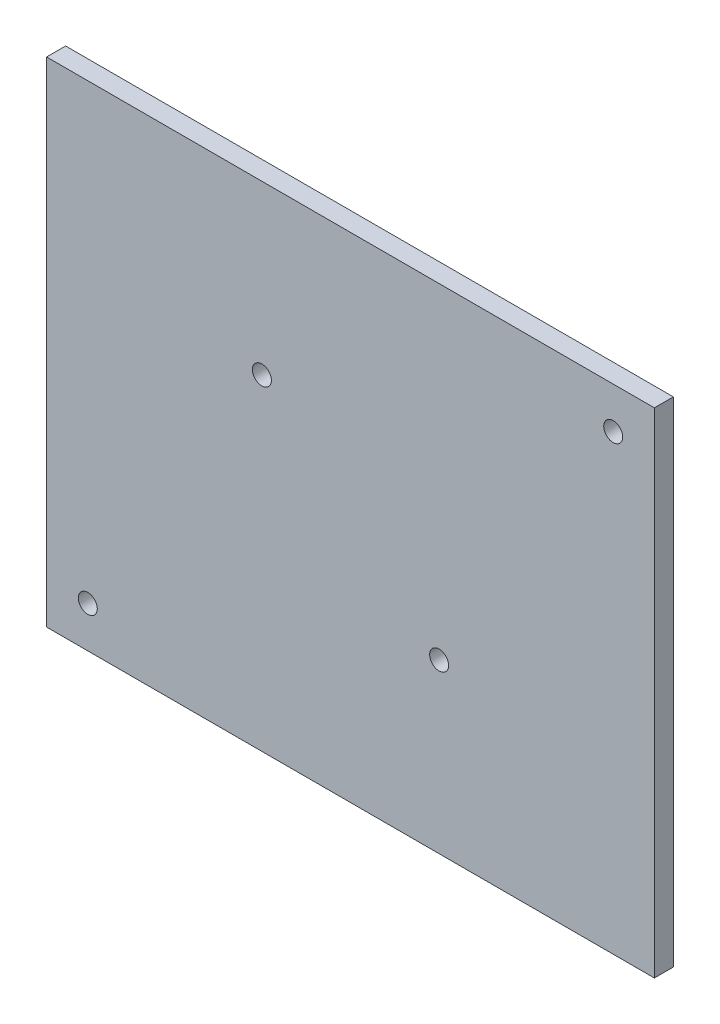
ISO-10303-21;
HEADER;
FILE_DESCRIPTION(('STEP AP214'),'2;1');
FILE_NAME('part.step','',(''),(''),'','','');
FILE_SCHEMA(('AUTOMOTIVE_DESIGN { 1 0 10303 214 1 1 1 1 }'));
ENDSEC;
DATA;
#1=APPLICATION_CONTEXT('core data for automotive mechanical design processes');
#2=APPLICATION_PROTOCOL_DEFINITION('international standard','automotive_design',2000,#1);
#3=PRODUCT_CONTEXT('',#1,'mechanical');
#4=PRODUCT('Part','Part','',(#3));
#5=PRODUCT_RELATED_PRODUCT_CATEGORY('part','',(#4));
#6=PRODUCT_DEFINITION_FORMATION('','',#4);
#7=PRODUCT_DEFINITION_CONTEXT('part definition',#1,'design');
#8=PRODUCT_DEFINITION('design','',#6,#7);
#9=PRODUCT_DEFINITION_SHAPE('','',#8);
#10=(LENGTH_UNIT() NAMED_UNIT(*) SI_UNIT(.MILLI.,.METRE.));
#11=(NAMED_UNIT(*) PLANE_ANGLE_UNIT() SI_UNIT($,.RADIAN.));
#12=(NAMED_UNIT(*) SI_UNIT($,.STERADIAN.) SOLID_ANGLE_UNIT());
#13=UNCERTAINTY_MEASURE_WITH_UNIT(LENGTH_MEASURE(1.E-05),#10,'distance_accuracy_value','');
#14=(GEOMETRIC_REPRESENTATION_CONTEXT(3) GLOBAL_UNCERTAINTY_ASSIGNED_CONTEXT((#13)) GLOBAL_UNIT_ASSIGNED_CONTEXT((#10,
#11,#12)) REPRESENTATION_CONTEXT('',''));
#15=CARTESIAN_POINT('',(0.,0.,0.));
#16=DIRECTION('',(0.,0.,1.));
#17=DIRECTION('',(1.,0.,0.));
#18=AXIS2_PLACEMENT_3D('',#15,#16,#17);
#19=CARTESIAN_POINT('',(0.,-39.,-3.));
#20=DIRECTION('',(0.,-1.,0.));
#21=DIRECTION('',(0.,0.,-1.));
#22=AXIS2_PLACEMENT_3D('',#19,#20,#21);
#23=PLANE('',#22);
#24=DIRECTION('',(1.,0.,0.));
#25=VECTOR('',#24,1.);
#26=CARTESIAN_POINT('',(0.,-39.,0.));
#27=LINE('',#26,#25);
#28=CARTESIAN_POINT('',(-48.,-39.,0.));
#29=VERTEX_POINT('',#28);
#30=CARTESIAN_POINT('',(48.,-39.,0.));
#31=VERTEX_POINT('',#30);
#32=EDGE_CURVE('E117',#29,#31,#27,.T.);
#33=ORIENTED_EDGE('',*,*,#32,.F.);
#34=DIRECTION('',(0.,0.,1.));
#35=VECTOR('',#34,1.);
#36=CARTESIAN_POINT('',(-48.,-39.,-3.));
#37=LINE('',#36,#35);
#38=CARTESIAN_POINT('',(-48.,-39.,-3.));
#39=VERTEX_POINT('',#38);
#40=EDGE_CURVE('E12',#39,#29,#37,.T.);
#41=ORIENTED_EDGE('',*,*,#40,.F.);
#42=DIRECTION('',(1.,0.,0.));
#43=VECTOR('',#42,1.);
#44=CARTESIAN_POINT('',(0.,-39.,-3.));
#45=LINE('',#44,#43);
#46=CARTESIAN_POINT('',(48.,-39.,-3.));
#47=VERTEX_POINT('',#46);
#48=EDGE_CURVE('E109',#39,#47,#45,.T.);
#49=ORIENTED_EDGE('',*,*,#48,.T.);
#50=DIRECTION('',(0.,0.,1.));
#51=VECTOR('',#50,1.);
#52=CARTESIAN_POINT('',(48.,-39.,-3.));
#53=LINE('',#52,#51);
#54=EDGE_CURVE('E48',#47,#31,#53,.T.);
#55=ORIENTED_EDGE('',*,*,#54,.T.);
#56=EDGE_LOOP('',(#33,#41,#49,#55));
#57=FACE_BOUND('',#56,.T.);
#58=ADVANCED_FACE('F45',(#57),#23,.T.);
#59=CARTESIAN_POINT('',(-48.,0.,-3.));
#60=DIRECTION('',(1.,0.,0.));
#61=DIRECTION('',(0.,0.,-1.));
#62=AXIS2_PLACEMENT_3D('',#59,#60,#61);
#63=PLANE('',#62);
#64=DIRECTION('',(0.,1.,0.));
#65=VECTOR('',#64,1.);
#66=CARTESIAN_POINT('',(-48.,0.,0.));
#67=LINE('',#66,#65);
#68=CARTESIAN_POINT('',(-48.,39.,0.));
#69=VERTEX_POINT('',#68);
#70=EDGE_CURVE('E79',#29,#69,#67,.T.);
#71=ORIENTED_EDGE('',*,*,#70,.T.);
#72=DIRECTION('',(0.,0.,1.));
#73=VECTOR('',#72,1.);
#74=CARTESIAN_POINT('',(-48.,39.,-3.));
#75=LINE('',#74,#73);
#76=CARTESIAN_POINT('',(-48.,39.,-3.));
#77=VERTEX_POINT('',#76);
#78=EDGE_CURVE('E55',#77,#69,#75,.T.);
#79=ORIENTED_EDGE('',*,*,#78,.F.);
#80=DIRECTION('',(0.,1.,0.));
#81=VECTOR('',#80,1.);
#82=CARTESIAN_POINT('',(-48.,0.,-3.));
#83=LINE('',#82,#81);
#84=EDGE_CURVE('E96',#39,#77,#83,.T.);
#85=ORIENTED_EDGE('',*,*,#84,.F.);
#86=ORIENTED_EDGE('',*,*,#40,.T.);
#87=EDGE_LOOP('',(#71,#79,#85,#86));
#88=FACE_BOUND('',#87,.T.);
#89=ADVANCED_FACE('F134',(#88),#63,.F.);
#90=CARTESIAN_POINT('',(0.,39.,-3.));
#91=DIRECTION('',(0.,-1.,0.));
#92=DIRECTION('',(0.,0.,-1.));
#93=AXIS2_PLACEMENT_3D('',#90,#91,#92);
#94=PLANE('',#93);
#95=DIRECTION('',(1.,0.,0.));
#96=VECTOR('',#95,1.);
#97=CARTESIAN_POINT('',(0.,39.,0.));
#98=LINE('',#97,#96);
#99=CARTESIAN_POINT('',(48.,39.,0.));
#100=VERTEX_POINT('',#99);
#101=EDGE_CURVE('E104',#69,#100,#98,.T.);
#102=ORIENTED_EDGE('',*,*,#101,.T.);
#103=DIRECTION('',(0.,0.,1.));
#104=VECTOR('',#103,1.);
#105=CARTESIAN_POINT('',(48.,39.,-3.));
#106=LINE('',#105,#104);
#107=CARTESIAN_POINT('',(48.,39.,-3.));
#108=VERTEX_POINT('',#107);
#109=EDGE_CURVE('E101',#108,#100,#106,.T.);
#110=ORIENTED_EDGE('',*,*,#109,.F.);
#111=DIRECTION('',(1.,0.,0.));
#112=VECTOR('',#111,1.);
#113=CARTESIAN_POINT('',(0.,39.,-3.));
#114=LINE('',#113,#112);
#115=EDGE_CURVE('E91',#77,#108,#114,.T.);
#116=ORIENTED_EDGE('',*,*,#115,.F.);
#117=ORIENTED_EDGE('',*,*,#78,.T.);
#118=EDGE_LOOP('',(#102,#110,#116,#117));
#119=FACE_BOUND('',#118,.T.);
#120=ADVANCED_FACE('F102',(#119),#94,.F.);
#121=CARTESIAN_POINT('',(48.,0.,-3.));
#122=DIRECTION('',(1.,0.,0.));
#123=DIRECTION('',(0.,0.,-1.));
#124=AXIS2_PLACEMENT_3D('',#121,#122,#123);
#125=PLANE('',#124);
#126=DIRECTION('',(0.,1.,0.));
#127=VECTOR('',#126,1.);
#128=CARTESIAN_POINT('',(48.,0.,0.));
#129=LINE('',#128,#127);
#130=EDGE_CURVE('E121',#31,#100,#129,.T.);
#131=ORIENTED_EDGE('',*,*,#130,.F.);
#132=ORIENTED_EDGE('',*,*,#54,.F.);
#133=DIRECTION('',(0.,1.,0.));
#134=VECTOR('',#133,1.);
#135=CARTESIAN_POINT('',(48.,0.,-3.));
#136=LINE('',#135,#134);
#137=EDGE_CURVE('E95',#47,#108,#136,.T.);
#138=ORIENTED_EDGE('',*,*,#137,.T.);
#139=ORIENTED_EDGE('',*,*,#109,.T.);
#140=EDGE_LOOP('',(#131,#132,#138,#139));
#141=FACE_BOUND('',#140,.T.);
#142=ADVANCED_FACE('F107',(#141),#125,.T.);
#143=CARTESIAN_POINT('',(0.,0.,-3.));
#144=DIRECTION('',(0.,0.,1.));
#145=DIRECTION('',(1.,0.,0.));
#146=AXIS2_PLACEMENT_3D('',#143,#144,#145);
#147=PLANE('',#146);
#148=CARTESIAN_POINT('',(14.,-12.5,-3.));
#149=DIRECTION('',(0.,0.,1.));
#150=DIRECTION('',(1.,0.,0.));
#151=AXIS2_PLACEMENT_3D('',#148,#149,#150);
#152=CIRCLE('',#151,1.5);
#153=CARTESIAN_POINT('',(15.5,-12.5,-3.));
#154=VERTEX_POINT('',#153);
#155=EDGE_CURVE('E197',#154,#154,#152,.T.);
#156=ORIENTED_EDGE('',*,*,#155,.T.);
#157=EDGE_LOOP('',(#156));
#158=FACE_BOUND('',#157,.T.);
#159=CARTESIAN_POINT('',(-41.5,-32.5000000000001,-3.));
#160=DIRECTION('',(0.,0.,1.));
#161=DIRECTION('',(1.,0.,0.));
#162=AXIS2_PLACEMENT_3D('',#159,#160,#161);
#163=CIRCLE('',#162,1.5);
#164=CARTESIAN_POINT('',(-40.,-32.5000000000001,-3.));
#165=VERTEX_POINT('',#164);
#166=EDGE_CURVE('E183',#165,#165,#163,.T.);
#167=ORIENTED_EDGE('',*,*,#166,.T.);
#168=EDGE_LOOP('',(#167));
#169=FACE_BOUND('',#168,.T.);
#170=CARTESIAN_POINT('',(41.5,32.4999999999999,-3.));
#171=DIRECTION('',(0.,0.,1.));
#172=DIRECTION('',(1.,0.,0.));
#173=AXIS2_PLACEMENT_3D('',#170,#171,#172);
#174=CIRCLE('',#173,1.5);
#175=CARTESIAN_POINT('',(43.,32.4999999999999,-3.));
#176=VERTEX_POINT('',#175);
#177=EDGE_CURVE('E177',#176,#176,#174,.T.);
#178=ORIENTED_EDGE('',*,*,#177,.T.);
#179=EDGE_LOOP('',(#178));
#180=FACE_BOUND('',#179,.T.);
#181=CARTESIAN_POINT('',(-14.,12.5,-3.));
#182=DIRECTION('',(0.,0.,1.));
#183=DIRECTION('',(1.,0.,0.));
#184=AXIS2_PLACEMENT_3D('',#181,#182,#183);
#185=CIRCLE('',#184,1.5);
#186=CARTESIAN_POINT('',(-12.5,12.5,-3.));
#187=VERTEX_POINT('',#186);
#188=EDGE_CURVE('E122',#187,#187,#185,.T.);
#189=ORIENTED_EDGE('',*,*,#188,.T.);
#190=EDGE_LOOP('',(#189));
#191=FACE_BOUND('',#190,.T.);
#192=ORIENTED_EDGE('',*,*,#48,.F.);
#193=ORIENTED_EDGE('',*,*,#84,.T.);
#194=ORIENTED_EDGE('',*,*,#115,.T.);
#195=ORIENTED_EDGE('',*,*,#137,.F.);
#196=EDGE_LOOP('',(#192,#193,#194,#195));
#197=FACE_BOUND('',#196,.T.);
#198=ADVANCED_FACE('F94',(#158,#169,#180,#191,#197),#147,.F.);
#199=CARTESIAN_POINT('',(0.,0.,0.));
#200=DIRECTION('',(0.,0.,1.));
#201=DIRECTION('',(1.,0.,0.));
#202=AXIS2_PLACEMENT_3D('',#199,#200,#201);
#203=PLANE('',#202);
#204=CARTESIAN_POINT('',(14.,-12.5,0.));
#205=DIRECTION('',(0.,0.,1.));
#206=DIRECTION('',(1.,0.,0.));
#207=AXIS2_PLACEMENT_3D('',#204,#205,#206);
#208=CIRCLE('',#207,1.5);
#209=CARTESIAN_POINT('',(15.5,-12.5,0.));
#210=VERTEX_POINT('',#209);
#211=EDGE_CURVE('E192',#210,#210,#208,.T.);
#212=ORIENTED_EDGE('',*,*,#211,.F.);
#213=EDGE_LOOP('',(#212));
#214=FACE_BOUND('',#213,.T.);
#215=CARTESIAN_POINT('',(-41.5,-32.5000000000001,0.));
#216=DIRECTION('',(0.,0.,1.));
#217=DIRECTION('',(1.,0.,0.));
#218=AXIS2_PLACEMENT_3D('',#215,#216,#217);
#219=CIRCLE('',#218,1.5);
#220=CARTESIAN_POINT('',(-40.,-32.5000000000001,0.));
#221=VERTEX_POINT('',#220);
#222=EDGE_CURVE('E188',#221,#221,#219,.T.);
#223=ORIENTED_EDGE('',*,*,#222,.F.);
#224=EDGE_LOOP('',(#223));
#225=FACE_BOUND('',#224,.T.);
#226=CARTESIAN_POINT('',(41.5,32.4999999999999,0.));
#227=DIRECTION('',(0.,0.,1.));
#228=DIRECTION('',(1.,0.,0.));
#229=AXIS2_PLACEMENT_3D('',#226,#227,#228);
#230=CIRCLE('',#229,1.5);
#231=CARTESIAN_POINT('',(43.,32.4999999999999,0.));
#232=VERTEX_POINT('',#231);
#233=EDGE_CURVE('E180',#232,#232,#230,.T.);
#234=ORIENTED_EDGE('',*,*,#233,.F.);
#235=EDGE_LOOP('',(#234));
#236=FACE_BOUND('',#235,.T.);
#237=CARTESIAN_POINT('',(-14.,12.5,0.));
#238=DIRECTION('',(0.,0.,1.));
#239=DIRECTION('',(1.,0.,0.));
#240=AXIS2_PLACEMENT_3D('',#237,#238,#239);
#241=CIRCLE('',#240,1.5);
#242=CARTESIAN_POINT('',(-12.5,12.5,0.));
#243=VERTEX_POINT('',#242);
#244=EDGE_CURVE('E196',#243,#243,#241,.T.);
#245=ORIENTED_EDGE('',*,*,#244,.F.);
#246=EDGE_LOOP('',(#245));
#247=FACE_BOUND('',#246,.T.);
#248=ORIENTED_EDGE('',*,*,#32,.T.);
#249=ORIENTED_EDGE('',*,*,#130,.T.);
#250=ORIENTED_EDGE('',*,*,#101,.F.);
#251=ORIENTED_EDGE('',*,*,#70,.F.);
#252=EDGE_LOOP('',(#248,#249,#250,#251));
#253=FACE_BOUND('',#252,.T.);
#254=ADVANCED_FACE('F131',(#214,#225,#236,#247,#253),#203,.T.);
#255=CARTESIAN_POINT('',(-14.,12.5,-3.));
#256=DIRECTION('',(0.,0.,1.));
#257=DIRECTION('',(1.,0.,0.));
#258=AXIS2_PLACEMENT_3D('',#255,#256,#257);
#259=CYLINDRICAL_SURFACE('',#258,1.5);
#260=ORIENTED_EDGE('',*,*,#188,.F.);
#261=EDGE_LOOP('',(#260));
#262=FACE_BOUND('',#261,.T.);
#263=ORIENTED_EDGE('',*,*,#244,.T.);
#264=EDGE_LOOP('',(#263));
#265=FACE_BOUND('',#264,.T.);
#266=ADVANCED_FACE('F153',(#262,#265),#259,.F.);
#267=CARTESIAN_POINT('',(41.5,32.4999999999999,-3.));
#268=DIRECTION('',(0.,0.,1.));
#269=DIRECTION('',(1.,0.,0.));
#270=AXIS2_PLACEMENT_3D('',#267,#268,#269);
#271=CYLINDRICAL_SURFACE('',#270,1.5);
#272=ORIENTED_EDGE('',*,*,#177,.F.);
#273=EDGE_LOOP('',(#272));
#274=FACE_BOUND('',#273,.T.);
#275=ORIENTED_EDGE('',*,*,#233,.T.);
#276=EDGE_LOOP('',(#275));
#277=FACE_BOUND('',#276,.T.);
#278=ADVANCED_FACE('F160',(#274,#277),#271,.F.);
#279=CARTESIAN_POINT('',(-41.5,-32.5000000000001,-3.));
#280=DIRECTION('',(0.,0.,1.));
#281=DIRECTION('',(1.,0.,0.));
#282=AXIS2_PLACEMENT_3D('',#279,#280,#281);
#283=CYLINDRICAL_SURFACE('',#282,1.5);
#284=ORIENTED_EDGE('',*,*,#166,.F.);
#285=EDGE_LOOP('',(#284));
#286=FACE_BOUND('',#285,.T.);
#287=ORIENTED_EDGE('',*,*,#222,.T.);
#288=EDGE_LOOP('',(#287));
#289=FACE_BOUND('',#288,.T.);
#290=ADVANCED_FACE('F162',(#286,#289),#283,.F.);
#291=CARTESIAN_POINT('',(14.,-12.5,-3.));
#292=DIRECTION('',(0.,0.,1.));
#293=DIRECTION('',(1.,0.,0.));
#294=AXIS2_PLACEMENT_3D('',#291,#292,#293);
#295=CYLINDRICAL_SURFACE('',#294,1.5);
#296=ORIENTED_EDGE('',*,*,#155,.F.);
#297=EDGE_LOOP('',(#296));
#298=FACE_BOUND('',#297,.T.);
#299=ORIENTED_EDGE('',*,*,#211,.T.);
#300=EDGE_LOOP('',(#299));
#301=FACE_BOUND('',#300,.T.);
#302=ADVANCED_FACE('F165',(#298,#301),#295,.F.);
#303=CLOSED_SHELL('',(#58,#89,#120,#142,#198,#254,#266,#278,#290,#302));
#304=MANIFOLD_SOLID_BREP('B2',#303);
#305=ADVANCED_BREP_SHAPE_REPRESENTATION('',(#18,#304),#14);
#306=SHAPE_DEFINITION_REPRESENTATION(#9,#305);
ENDSEC;
END-ISO-10303-21;
